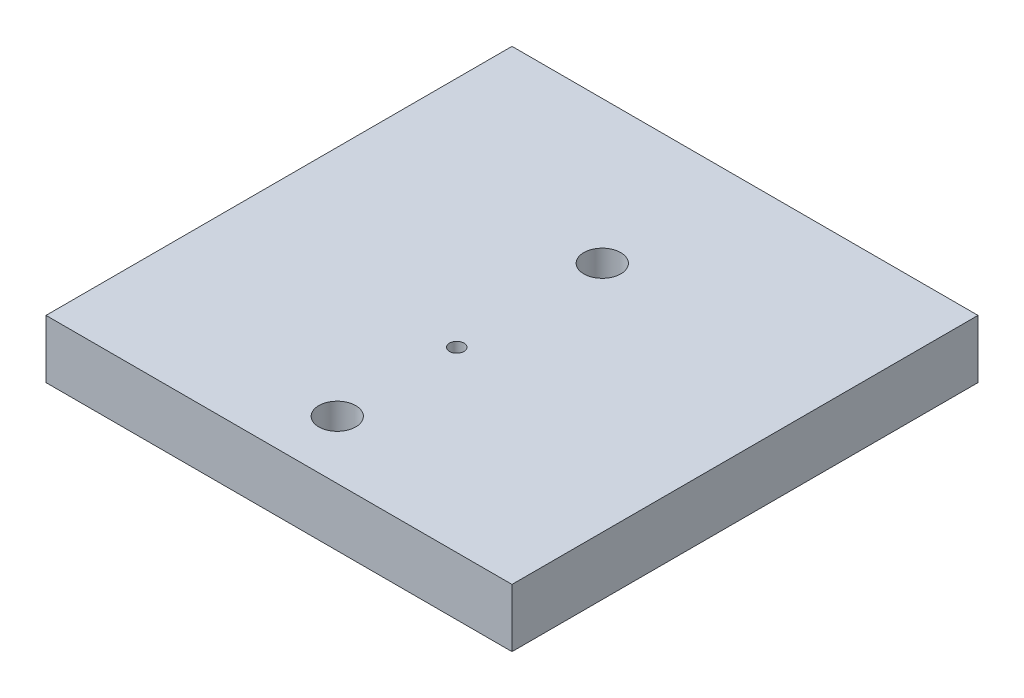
ISO-10303-21;
HEADER;
FILE_DESCRIPTION(('STEP AP214'),'2;1');
FILE_NAME('part.step','',(''),(''),'','','');
FILE_SCHEMA(('AUTOMOTIVE_DESIGN { 1 0 10303 214 1 1 1 1 }'));
ENDSEC;
DATA;
#1=APPLICATION_CONTEXT('core data for automotive mechanical design processes');
#2=APPLICATION_PROTOCOL_DEFINITION('international standard','automotive_design',2000,#1);
#3=PRODUCT_CONTEXT('',#1,'mechanical');
#4=PRODUCT('Part','Part','',(#3));
#5=PRODUCT_RELATED_PRODUCT_CATEGORY('part','',(#4));
#6=PRODUCT_DEFINITION_FORMATION('','',#4);
#7=PRODUCT_DEFINITION_CONTEXT('part definition',#1,'design');
#8=PRODUCT_DEFINITION('design','',#6,#7);
#9=PRODUCT_DEFINITION_SHAPE('','',#8);
#10=(LENGTH_UNIT() NAMED_UNIT(*) SI_UNIT(.MILLI.,.METRE.));
#11=(NAMED_UNIT(*) PLANE_ANGLE_UNIT() SI_UNIT($,.RADIAN.));
#12=(NAMED_UNIT(*) SI_UNIT($,.STERADIAN.) SOLID_ANGLE_UNIT());
#13=UNCERTAINTY_MEASURE_WITH_UNIT(LENGTH_MEASURE(1.E-05),#10,'distance_accuracy_value','');
#14=(GEOMETRIC_REPRESENTATION_CONTEXT(3) GLOBAL_UNCERTAINTY_ASSIGNED_CONTEXT((#13)) GLOBAL_UNIT_ASSIGNED_CONTEXT((#10,
#11,#12)) REPRESENTATION_CONTEXT('',''));
#15=CARTESIAN_POINT('',(0.,0.,0.));
#16=DIRECTION('',(0.,0.,1.));
#17=DIRECTION('',(1.,0.,0.));
#18=AXIS2_PLACEMENT_3D('',#15,#16,#17);
#19=CARTESIAN_POINT('',(40.,10.,40.));
#20=DIRECTION('',(-1.,0.,0.));
#21=DIRECTION('',(0.,0.,1.));
#22=AXIS2_PLACEMENT_3D('',#19,#20,#21);
#23=PLANE('',#22);
#24=DIRECTION('',(0.,0.,-1.));
#25=VECTOR('',#24,1.);
#26=CARTESIAN_POINT('',(40.,0.,40.));
#27=LINE('',#26,#25);
#28=CARTESIAN_POINT('',(40.,0.,40.));
#29=VERTEX_POINT('',#28);
#30=CARTESIAN_POINT('',(40.,0.,-40.));
#31=VERTEX_POINT('',#30);
#32=EDGE_CURVE('E104',#29,#31,#27,.T.);
#33=ORIENTED_EDGE('',*,*,#32,.T.);
#34=DIRECTION('',(0.,-1.,0.));
#35=VECTOR('',#34,1.);
#36=CARTESIAN_POINT('',(40.,10.,-40.));
#37=LINE('',#36,#35);
#38=CARTESIAN_POINT('',(40.,10.,-40.));
#39=VERTEX_POINT('',#38);
#40=EDGE_CURVE('E11',#39,#31,#37,.T.);
#41=ORIENTED_EDGE('',*,*,#40,.F.);
#42=DIRECTION('',(0.,0.,-1.));
#43=VECTOR('',#42,1.);
#44=CARTESIAN_POINT('',(40.,10.,40.));
#45=LINE('',#44,#43);
#46=CARTESIAN_POINT('',(40.,10.,40.));
#47=VERTEX_POINT('',#46);
#48=EDGE_CURVE('E92',#47,#39,#45,.T.);
#49=ORIENTED_EDGE('',*,*,#48,.F.);
#50=DIRECTION('',(0.,-1.,0.));
#51=VECTOR('',#50,1.);
#52=CARTESIAN_POINT('',(40.,10.,40.));
#53=LINE('',#52,#51);
#54=EDGE_CURVE('E100',#47,#29,#53,.T.);
#55=ORIENTED_EDGE('',*,*,#54,.T.);
#56=EDGE_LOOP('',(#33,#41,#49,#55));
#57=FACE_BOUND('',#56,.T.);
#58=ADVANCED_FACE('F41',(#57),#23,.F.);
#59=CARTESIAN_POINT('',(-40.,10.,-40.));
#60=DIRECTION('',(0.,0.,1.));
#61=DIRECTION('',(1.,0.,0.));
#62=AXIS2_PLACEMENT_3D('',#59,#60,#61);
#63=PLANE('',#62);
#64=DIRECTION('',(-1.,0.,0.));
#65=VECTOR('',#64,1.);
#66=CARTESIAN_POINT('',(-40.,0.,-40.));
#67=LINE('',#66,#65);
#68=CARTESIAN_POINT('',(-40.,0.,-40.));
#69=VERTEX_POINT('',#68);
#70=EDGE_CURVE('E96',#31,#69,#67,.T.);
#71=ORIENTED_EDGE('',*,*,#70,.T.);
#72=DIRECTION('',(0.,-1.,0.));
#73=VECTOR('',#72,1.);
#74=CARTESIAN_POINT('',(-40.,10.,-40.));
#75=LINE('',#74,#73);
#76=CARTESIAN_POINT('',(-40.,10.,-40.));
#77=VERTEX_POINT('',#76);
#78=EDGE_CURVE('E49',#77,#69,#75,.T.);
#79=ORIENTED_EDGE('',*,*,#78,.F.);
#80=DIRECTION('',(-1.,0.,0.));
#81=VECTOR('',#80,1.);
#82=CARTESIAN_POINT('',(-40.,10.,-40.));
#83=LINE('',#82,#81);
#84=EDGE_CURVE('E87',#39,#77,#83,.T.);
#85=ORIENTED_EDGE('',*,*,#84,.F.);
#86=ORIENTED_EDGE('',*,*,#40,.T.);
#87=EDGE_LOOP('',(#71,#79,#85,#86));
#88=FACE_BOUND('',#87,.T.);
#89=ADVANCED_FACE('F95',(#88),#63,.F.);
#90=CARTESIAN_POINT('',(-40.,10.,40.));
#91=DIRECTION('',(1.,0.,0.));
#92=DIRECTION('',(0.,0.,-1.));
#93=AXIS2_PLACEMENT_3D('',#90,#91,#92);
#94=PLANE('',#93);
#95=DIRECTION('',(0.,0.,1.));
#96=VECTOR('',#95,1.);
#97=CARTESIAN_POINT('',(-40.,0.,40.));
#98=LINE('',#97,#96);
#99=CARTESIAN_POINT('',(-40.,0.,40.));
#100=VERTEX_POINT('',#99);
#101=EDGE_CURVE('E74',#69,#100,#98,.T.);
#102=ORIENTED_EDGE('',*,*,#101,.T.);
#103=DIRECTION('',(0.,-1.,0.));
#104=VECTOR('',#103,1.);
#105=CARTESIAN_POINT('',(-40.,10.,40.));
#106=LINE('',#105,#104);
#107=CARTESIAN_POINT('',(-40.,10.,40.));
#108=VERTEX_POINT('',#107);
#109=EDGE_CURVE('E97',#108,#100,#106,.T.);
#110=ORIENTED_EDGE('',*,*,#109,.F.);
#111=DIRECTION('',(0.,0.,1.));
#112=VECTOR('',#111,1.);
#113=CARTESIAN_POINT('',(-40.,10.,40.));
#114=LINE('',#113,#112);
#115=EDGE_CURVE('E90',#77,#108,#114,.T.);
#116=ORIENTED_EDGE('',*,*,#115,.F.);
#117=ORIENTED_EDGE('',*,*,#78,.T.);
#118=EDGE_LOOP('',(#102,#110,#116,#117));
#119=FACE_BOUND('',#118,.T.);
#120=ADVANCED_FACE('F98',(#119),#94,.F.);
#121=CARTESIAN_POINT('',(-40.,10.,40.));
#122=DIRECTION('',(0.,0.,-1.));
#123=DIRECTION('',(-1.,0.,0.));
#124=AXIS2_PLACEMENT_3D('',#121,#122,#123);
#125=PLANE('',#124);
#126=DIRECTION('',(1.,0.,0.));
#127=VECTOR('',#126,1.);
#128=CARTESIAN_POINT('',(-40.,0.,40.));
#129=LINE('',#128,#127);
#130=EDGE_CURVE('E80',#100,#29,#129,.T.);
#131=ORIENTED_EDGE('',*,*,#130,.T.);
#132=ORIENTED_EDGE('',*,*,#54,.F.);
#133=DIRECTION('',(1.,0.,0.));
#134=VECTOR('',#133,1.);
#135=CARTESIAN_POINT('',(-40.,10.,40.));
#136=LINE('',#135,#134);
#137=EDGE_CURVE('E57',#108,#47,#136,.T.);
#138=ORIENTED_EDGE('',*,*,#137,.F.);
#139=ORIENTED_EDGE('',*,*,#109,.T.);
#140=EDGE_LOOP('',(#131,#132,#138,#139));
#141=FACE_BOUND('',#140,.T.);
#142=ADVANCED_FACE('F112',(#141),#125,.F.);
#143=CARTESIAN_POINT('',(0.,10.,0.));
#144=DIRECTION('',(0.,-1.,0.));
#145=DIRECTION('',(0.,0.,-1.));
#146=AXIS2_PLACEMENT_3D('',#143,#144,#145);
#147=PLANE('',#146);
#148=CARTESIAN_POINT('',(0.,10.,30.));
#149=DIRECTION('',(0.,1.,0.));
#150=DIRECTION('',(0.,0.,1.));
#151=AXIS2_PLACEMENT_3D('',#148,#149,#150);
#152=CIRCLE('',#151,3.175);
#153=CARTESIAN_POINT('',(0.,10.,33.175));
#154=VERTEX_POINT('',#153);
#155=EDGE_CURVE('E130',#154,#154,#152,.T.);
#156=ORIENTED_EDGE('',*,*,#155,.F.);
#157=EDGE_LOOP('',(#156));
#158=FACE_BOUND('',#157,.T.);
#159=CARTESIAN_POINT('',(0.,10.,9.48999999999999));
#160=DIRECTION('',(0.,1.,0.));
#161=DIRECTION('',(0.,0.,1.));
#162=AXIS2_PLACEMENT_3D('',#159,#160,#161);
#163=CIRCLE('',#162,1.25);
#164=CARTESIAN_POINT('',(0.,10.,10.74));
#165=VERTEX_POINT('',#164);
#166=EDGE_CURVE('E127',#165,#165,#163,.T.);
#167=ORIENTED_EDGE('',*,*,#166,.F.);
#168=EDGE_LOOP('',(#167));
#169=FACE_BOUND('',#168,.T.);
#170=CARTESIAN_POINT('',(0.,10.,-15.5));
#171=DIRECTION('',(0.,1.,0.));
#172=DIRECTION('',(0.,0.,1.));
#173=AXIS2_PLACEMENT_3D('',#170,#171,#172);
#174=CIRCLE('',#173,3.175);
#175=CARTESIAN_POINT('',(0.,10.,-12.325));
#176=VERTEX_POINT('',#175);
#177=EDGE_CURVE('E121',#176,#176,#174,.T.);
#178=ORIENTED_EDGE('',*,*,#177,.F.);
#179=EDGE_LOOP('',(#178));
#180=FACE_BOUND('',#179,.T.);
#181=ORIENTED_EDGE('',*,*,#48,.T.);
#182=ORIENTED_EDGE('',*,*,#84,.T.);
#183=ORIENTED_EDGE('',*,*,#115,.T.);
#184=ORIENTED_EDGE('',*,*,#137,.T.);
#185=EDGE_LOOP('',(#181,#182,#183,#184));
#186=FACE_BOUND('',#185,.T.);
#187=ADVANCED_FACE('F88',(#158,#169,#180,#186),#147,.F.);
#188=CARTESIAN_POINT('',(0.,0.,0.));
#189=DIRECTION('',(0.,-1.,0.));
#190=DIRECTION('',(0.,0.,-1.));
#191=AXIS2_PLACEMENT_3D('',#188,#189,#190);
#192=PLANE('',#191);
#193=CARTESIAN_POINT('',(0.,0.,30.));
#194=DIRECTION('',(0.,1.,0.));
#195=DIRECTION('',(0.,0.,1.));
#196=AXIS2_PLACEMENT_3D('',#193,#194,#195);
#197=CIRCLE('',#196,3.175);
#198=CARTESIAN_POINT('',(0.,0.,33.175));
#199=VERTEX_POINT('',#198);
#200=EDGE_CURVE('E107',#199,#199,#197,.T.);
#201=ORIENTED_EDGE('',*,*,#200,.T.);
#202=EDGE_LOOP('',(#201));
#203=FACE_BOUND('',#202,.T.);
#204=CARTESIAN_POINT('',(0.,0.,9.48999999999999));
#205=DIRECTION('',(0.,1.,0.));
#206=DIRECTION('',(0.,0.,1.));
#207=AXIS2_PLACEMENT_3D('',#204,#205,#206);
#208=CIRCLE('',#207,1.25);
#209=CARTESIAN_POINT('',(0.,0.,10.74));
#210=VERTEX_POINT('',#209);
#211=EDGE_CURVE('E124',#210,#210,#208,.T.);
#212=ORIENTED_EDGE('',*,*,#211,.T.);
#213=EDGE_LOOP('',(#212));
#214=FACE_BOUND('',#213,.T.);
#215=CARTESIAN_POINT('',(0.,0.,-15.5));
#216=DIRECTION('',(0.,1.,0.));
#217=DIRECTION('',(0.,0.,1.));
#218=AXIS2_PLACEMENT_3D('',#215,#216,#217);
#219=CIRCLE('',#218,3.175);
#220=CARTESIAN_POINT('',(0.,0.,-12.325));
#221=VERTEX_POINT('',#220);
#222=EDGE_CURVE('E118',#221,#221,#219,.T.);
#223=ORIENTED_EDGE('',*,*,#222,.T.);
#224=EDGE_LOOP('',(#223));
#225=FACE_BOUND('',#224,.T.);
#226=ORIENTED_EDGE('',*,*,#32,.F.);
#227=ORIENTED_EDGE('',*,*,#130,.F.);
#228=ORIENTED_EDGE('',*,*,#101,.F.);
#229=ORIENTED_EDGE('',*,*,#70,.F.);
#230=EDGE_LOOP('',(#226,#227,#228,#229));
#231=FACE_BOUND('',#230,.T.);
#232=ADVANCED_FACE('F115',(#203,#214,#225,#231),#192,.T.);
#233=CARTESIAN_POINT('',(0.,0.,-15.5));
#234=DIRECTION('',(0.,1.,0.));
#235=DIRECTION('',(0.,0.,1.));
#236=AXIS2_PLACEMENT_3D('',#233,#234,#235);
#237=CYLINDRICAL_SURFACE('',#236,3.175);
#238=ORIENTED_EDGE('',*,*,#222,.F.);
#239=EDGE_LOOP('',(#238));
#240=FACE_BOUND('',#239,.T.);
#241=ORIENTED_EDGE('',*,*,#177,.T.);
#242=EDGE_LOOP('',(#241));
#243=FACE_BOUND('',#242,.T.);
#244=ADVANCED_FACE('F152',(#240,#243),#237,.F.);
#245=CARTESIAN_POINT('',(0.,0.,9.48999999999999));
#246=DIRECTION('',(0.,1.,0.));
#247=DIRECTION('',(0.,0.,1.));
#248=AXIS2_PLACEMENT_3D('',#245,#246,#247);
#249=CYLINDRICAL_SURFACE('',#248,1.25);
#250=ORIENTED_EDGE('',*,*,#211,.F.);
#251=EDGE_LOOP('',(#250));
#252=FACE_BOUND('',#251,.T.);
#253=ORIENTED_EDGE('',*,*,#166,.T.);
#254=EDGE_LOOP('',(#253));
#255=FACE_BOUND('',#254,.T.);
#256=ADVANCED_FACE('F141',(#252,#255),#249,.F.);
#257=CARTESIAN_POINT('',(0.,0.,30.));
#258=DIRECTION('',(0.,1.,0.));
#259=DIRECTION('',(0.,0.,1.));
#260=AXIS2_PLACEMENT_3D('',#257,#258,#259);
#261=CYLINDRICAL_SURFACE('',#260,3.175);
#262=ORIENTED_EDGE('',*,*,#200,.F.);
#263=EDGE_LOOP('',(#262));
#264=FACE_BOUND('',#263,.T.);
#265=ORIENTED_EDGE('',*,*,#155,.T.);
#266=EDGE_LOOP('',(#265));
#267=FACE_BOUND('',#266,.T.);
#268=ADVANCED_FACE('F138',(#264,#267),#261,.F.);
#269=CLOSED_SHELL('',(#58,#89,#120,#142,#187,#232,#244,#256,#268));
#270=MANIFOLD_SOLID_BREP('B2',#269);
#271=ADVANCED_BREP_SHAPE_REPRESENTATION('',(#18,#270),#14);
#272=SHAPE_DEFINITION_REPRESENTATION(#9,#271);
ENDSEC;
END-ISO-10303-21;
